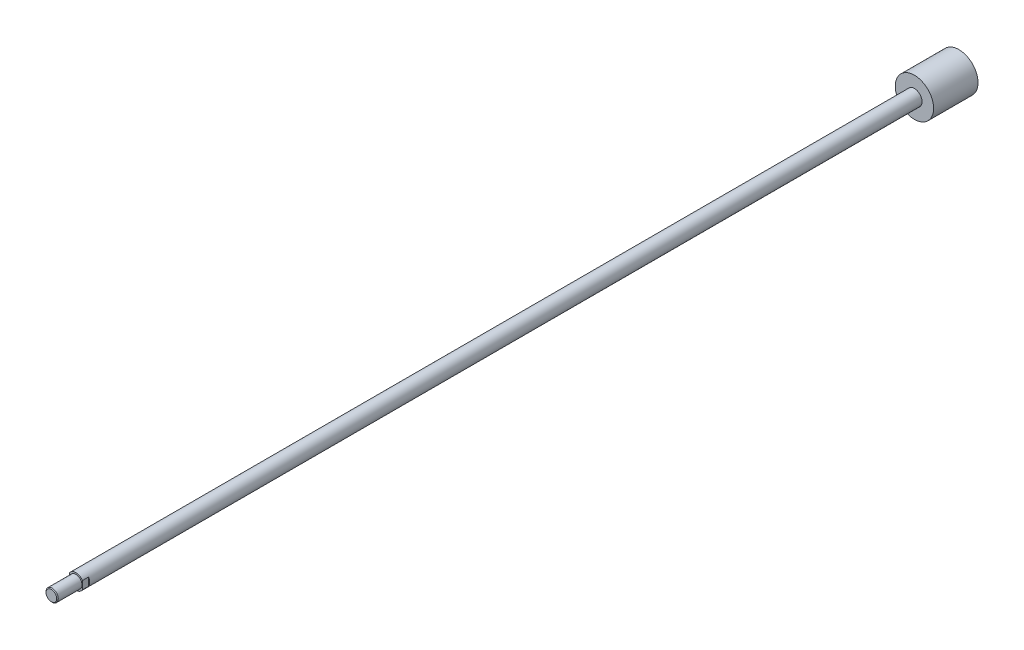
ISO-10303-21;
HEADER;
FILE_DESCRIPTION(('STEP AP214'),'2;1');
FILE_NAME('part.step','',(''),(''),'','','');
FILE_SCHEMA(('AUTOMOTIVE_DESIGN { 1 0 10303 214 1 1 1 1 }'));
ENDSEC;
DATA;
#1=APPLICATION_CONTEXT('core data for automotive mechanical design processes');
#2=APPLICATION_PROTOCOL_DEFINITION('international standard','automotive_design',2000,#1);
#3=PRODUCT_CONTEXT('',#1,'mechanical');
#4=PRODUCT('Part','Part','',(#3));
#5=PRODUCT_RELATED_PRODUCT_CATEGORY('part','',(#4));
#6=PRODUCT_DEFINITION_FORMATION('','',#4);
#7=PRODUCT_DEFINITION_CONTEXT('part definition',#1,'design');
#8=PRODUCT_DEFINITION('design','',#6,#7);
#9=PRODUCT_DEFINITION_SHAPE('','',#8);
#10=(LENGTH_UNIT() NAMED_UNIT(*) SI_UNIT(.MILLI.,.METRE.));
#11=(NAMED_UNIT(*) PLANE_ANGLE_UNIT() SI_UNIT($,.RADIAN.));
#12=(NAMED_UNIT(*) SI_UNIT($,.STERADIAN.) SOLID_ANGLE_UNIT());
#13=UNCERTAINTY_MEASURE_WITH_UNIT(LENGTH_MEASURE(1.E-05),#10,'distance_accuracy_value','');
#14=(GEOMETRIC_REPRESENTATION_CONTEXT(3) GLOBAL_UNCERTAINTY_ASSIGNED_CONTEXT((#13)) GLOBAL_UNIT_ASSIGNED_CONTEXT((#10,
#11,#12)) REPRESENTATION_CONTEXT('',''));
#15=CARTESIAN_POINT('',(0.,0.,0.));
#16=DIRECTION('',(0.,0.,1.));
#17=DIRECTION('',(1.,0.,0.));
#18=AXIS2_PLACEMENT_3D('',#15,#16,#17);
#19=CARTESIAN_POINT('',(0.,0.,1152.));
#20=DIRECTION('',(0.,0.,1.));
#21=DIRECTION('',(1.,0.,0.));
#22=AXIS2_PLACEMENT_3D('',#19,#20,#21);
#23=PLANE('',#22);
#24=DIRECTION('',(0.,-1.,0.));
#25=VECTOR('',#24,1.);
#26=CARTESIAN_POINT('',(8.5,5.26782687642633,1152.));
#27=LINE('',#26,#25);
#28=CARTESIAN_POINT('',(8.5,5.26782687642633,1152.));
#29=VERTEX_POINT('',#28);
#30=CARTESIAN_POINT('',(8.5,-5.26782687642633,1152.));
#31=VERTEX_POINT('',#30);
#32=EDGE_CURVE('E66',#29,#31,#27,.T.);
#33=ORIENTED_EDGE('',*,*,#32,.F.);
#34=CARTESIAN_POINT('',(0.,0.,1152.));
#35=DIRECTION('',(0.,0.,1.));
#36=DIRECTION('',(1.,0.,0.));
#37=AXIS2_PLACEMENT_3D('',#34,#35,#36);
#38=CIRCLE('',#37,9.99999999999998);
#39=CARTESIAN_POINT('',(-8.5,5.26782687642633,1152.));
#40=VERTEX_POINT('',#39);
#41=EDGE_CURVE('E75',#29,#40,#38,.T.);
#42=ORIENTED_EDGE('',*,*,#41,.T.);
#43=DIRECTION('',(0.,1.,0.));
#44=VECTOR('',#43,1.);
#45=CARTESIAN_POINT('',(-8.5,5.26782687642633,1152.));
#46=LINE('',#45,#44);
#47=CARTESIAN_POINT('',(-8.5,-5.26782687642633,1152.));
#48=VERTEX_POINT('',#47);
#49=EDGE_CURVE('E77',#48,#40,#46,.T.);
#50=ORIENTED_EDGE('',*,*,#49,.F.);
#51=EDGE_CURVE('E90',#48,#31,#38,.T.);
#52=ORIENTED_EDGE('',*,*,#51,.T.);
#53=EDGE_LOOP('',(#33,#42,#50,#52));
#54=FACE_BOUND('',#53,.T.);
#55=CARTESIAN_POINT('',(0.,0.,1152.));
#56=DIRECTION('',(0.,0.,1.));
#57=DIRECTION('',(1.,0.,0.));
#58=AXIS2_PLACEMENT_3D('',#55,#56,#57);
#59=CIRCLE('',#58,8.);
#60=CARTESIAN_POINT('',(8.,0.,1152.));
#61=VERTEX_POINT('',#60);
#62=EDGE_CURVE('E230',#61,#61,#59,.T.);
#63=ORIENTED_EDGE('',*,*,#62,.F.);
#64=EDGE_LOOP('',(#63));
#65=FACE_BOUND('',#64,.T.);
#66=ADVANCED_FACE('F17',(#54,#65),#23,.T.);
#67=CARTESIAN_POINT('',(0.,0.,0.));
#68=DIRECTION('',(0.,0.,-1.));
#69=DIRECTION('',(-1.,0.,0.));
#70=AXIS2_PLACEMENT_3D('',#67,#68,#69);
#71=PLANE('',#70);
#72=CARTESIAN_POINT('',(0.,0.,0.));
#73=DIRECTION('',(0.,0.,-1.));
#74=DIRECTION('',(-1.,0.,0.));
#75=AXIS2_PLACEMENT_3D('',#72,#73,#74);
#76=CIRCLE('',#75,25.);
#77=CARTESIAN_POINT('',(-25.,0.,0.));
#78=VERTEX_POINT('',#77);
#79=EDGE_CURVE('E99',#78,#78,#76,.T.);
#80=ORIENTED_EDGE('',*,*,#79,.T.);
#81=EDGE_LOOP('',(#80));
#82=FACE_BOUND('',#81,.T.);
#83=ADVANCED_FACE('F117',(#82),#71,.T.);
#84=CARTESIAN_POINT('',(0.,0.,-31.0732569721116));
#85=DIRECTION('',(0.,0.,-1.));
#86=DIRECTION('',(-1.,0.,0.));
#87=AXIS2_PLACEMENT_3D('',#84,#85,#86);
#88=CYLINDRICAL_SURFACE('',#87,25.);
#89=CARTESIAN_POINT('',(0.,0.,58.));
#90=DIRECTION('',(0.,0.,-1.));
#91=DIRECTION('',(-1.,0.,0.));
#92=AXIS2_PLACEMENT_3D('',#89,#90,#91);
#93=CIRCLE('',#92,25.);
#94=CARTESIAN_POINT('',(-25.,0.,58.));
#95=VERTEX_POINT('',#94);
#96=EDGE_CURVE('E96',#95,#95,#93,.T.);
#97=ORIENTED_EDGE('',*,*,#96,.T.);
#98=EDGE_LOOP('',(#97));
#99=FACE_BOUND('',#98,.T.);
#100=ORIENTED_EDGE('',*,*,#79,.F.);
#101=EDGE_LOOP('',(#100));
#102=FACE_BOUND('',#101,.T.);
#103=ADVANCED_FACE('F124',(#99,#102),#88,.T.);
#104=CARTESIAN_POINT('',(0.,25.,58.));
#105=DIRECTION('',(0.,0.,1.));
#106=DIRECTION('',(1.,0.,0.));
#107=AXIS2_PLACEMENT_3D('',#104,#105,#106);
#108=PLANE('',#107);
#109=CARTESIAN_POINT('',(0.,0.,58.));
#110=DIRECTION('',(0.,0.,-1.));
#111=DIRECTION('',(-1.,0.,0.));
#112=AXIS2_PLACEMENT_3D('',#109,#110,#111);
#113=CIRCLE('',#112,9.99999999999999);
#114=CARTESIAN_POINT('',(-9.99999999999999,0.,58.));
#115=VERTEX_POINT('',#114);
#116=EDGE_CURVE('E93',#115,#115,#113,.T.);
#117=ORIENTED_EDGE('',*,*,#116,.T.);
#118=EDGE_LOOP('',(#117));
#119=FACE_BOUND('',#118,.T.);
#120=ORIENTED_EDGE('',*,*,#96,.F.);
#121=EDGE_LOOP('',(#120));
#122=FACE_BOUND('',#121,.T.);
#123=ADVANCED_FACE('F133',(#119,#122),#108,.T.);
#124=CARTESIAN_POINT('',(0.,0.,-31.0732569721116));
#125=DIRECTION('',(0.,0.,-1.));
#126=DIRECTION('',(-1.,0.,0.));
#127=AXIS2_PLACEMENT_3D('',#124,#125,#126);
#128=CYLINDRICAL_SURFACE('',#127,9.99999999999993);
#129=DIRECTION('',(0.,0.,1.));
#130=VECTOR('',#129,1.);
#131=CARTESIAN_POINT('',(8.5,5.26782687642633,1144.));
#132=LINE('',#131,#130);
#133=CARTESIAN_POINT('',(8.5,5.26782687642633,1144.));
#134=VERTEX_POINT('',#133);
#135=EDGE_CURVE('E32',#134,#29,#132,.T.);
#136=ORIENTED_EDGE('',*,*,#135,.F.);
#137=CARTESIAN_POINT('',(0.,0.,1144.));
#138=DIRECTION('',(0.,0.,1.));
#139=DIRECTION('',(1.,0.,0.));
#140=AXIS2_PLACEMENT_3D('',#137,#138,#139);
#141=CIRCLE('',#140,9.99999999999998);
#142=CARTESIAN_POINT('',(8.5,-5.26782687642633,1144.));
#143=VERTEX_POINT('',#142);
#144=EDGE_CURVE('E61',#143,#134,#141,.T.);
#145=ORIENTED_EDGE('',*,*,#144,.F.);
#146=DIRECTION('',(0.,0.,1.));
#147=VECTOR('',#146,1.);
#148=CARTESIAN_POINT('',(8.5,-5.26782687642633,1144.));
#149=LINE('',#148,#147);
#150=EDGE_CURVE('E69',#143,#31,#149,.T.);
#151=ORIENTED_EDGE('',*,*,#150,.T.);
#152=ORIENTED_EDGE('',*,*,#51,.F.);
#153=DIRECTION('',(0.,0.,1.));
#154=VECTOR('',#153,1.);
#155=CARTESIAN_POINT('',(-8.5,-5.26782687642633,1144.));
#156=LINE('',#155,#154);
#157=CARTESIAN_POINT('',(-8.5,-5.26782687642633,1144.));
#158=VERTEX_POINT('',#157);
#159=EDGE_CURVE('E40',#158,#48,#156,.T.);
#160=ORIENTED_EDGE('',*,*,#159,.F.);
#161=CARTESIAN_POINT('',(0.,0.,1144.));
#162=DIRECTION('',(0.,0.,1.));
#163=DIRECTION('',(1.,0.,0.));
#164=AXIS2_PLACEMENT_3D('',#161,#162,#163);
#165=CIRCLE('',#164,9.99999999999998);
#166=CARTESIAN_POINT('',(-8.5,5.26782687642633,1144.));
#167=VERTEX_POINT('',#166);
#168=EDGE_CURVE('E81',#167,#158,#165,.T.);
#169=ORIENTED_EDGE('',*,*,#168,.F.);
#170=DIRECTION('',(0.,0.,1.));
#171=VECTOR('',#170,1.);
#172=CARTESIAN_POINT('',(-8.5,5.26782687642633,1144.));
#173=LINE('',#172,#171);
#174=EDGE_CURVE('E87',#167,#40,#173,.T.);
#175=ORIENTED_EDGE('',*,*,#174,.T.);
#176=ORIENTED_EDGE('',*,*,#41,.F.);
#177=EDGE_LOOP('',(#136,#145,#151,#152,#160,#169,#175,#176));
#178=FACE_BOUND('',#177,.T.);
#179=ORIENTED_EDGE('',*,*,#116,.F.);
#180=EDGE_LOOP('',(#179));
#181=FACE_BOUND('',#180,.T.);
#182=ADVANCED_FACE('F72',(#178,#181),#128,.T.);
#183=CARTESIAN_POINT('',(-8.5,5.26782687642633,1144.));
#184=DIRECTION('',(1.,0.,0.));
#185=DIRECTION('',(0.,0.,-1.));
#186=AXIS2_PLACEMENT_3D('',#183,#184,#185);
#187=PLANE('',#186);
#188=ORIENTED_EDGE('',*,*,#49,.T.);
#189=ORIENTED_EDGE('',*,*,#174,.F.);
#190=DIRECTION('',(0.,1.,0.));
#191=VECTOR('',#190,1.);
#192=CARTESIAN_POINT('',(-8.5,5.26782687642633,1144.));
#193=LINE('',#192,#191);
#194=EDGE_CURVE('E83',#158,#167,#193,.T.);
#195=ORIENTED_EDGE('',*,*,#194,.F.);
#196=ORIENTED_EDGE('',*,*,#159,.T.);
#197=EDGE_LOOP('',(#188,#189,#195,#196));
#198=FACE_BOUND('',#197,.T.);
#199=ADVANCED_FACE('F129',(#198),#187,.F.);
#200=CARTESIAN_POINT('',(0.,0.,1144.));
#201=DIRECTION('',(0.,0.,1.));
#202=DIRECTION('',(1.,0.,0.));
#203=AXIS2_PLACEMENT_3D('',#200,#201,#202);
#204=PLANE('',#203);
#205=ORIENTED_EDGE('',*,*,#168,.T.);
#206=ORIENTED_EDGE('',*,*,#194,.T.);
#207=EDGE_LOOP('',(#205,#206));
#208=FACE_BOUND('',#207,.T.);
#209=ADVANCED_FACE('F169',(#208),#204,.T.);
#210=CARTESIAN_POINT('',(8.5,5.26782687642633,1144.));
#211=DIRECTION('',(-1.,0.,0.));
#212=DIRECTION('',(0.,0.,1.));
#213=AXIS2_PLACEMENT_3D('',#210,#211,#212);
#214=PLANE('',#213);
#215=ORIENTED_EDGE('',*,*,#32,.T.);
#216=ORIENTED_EDGE('',*,*,#150,.F.);
#217=DIRECTION('',(0.,-1.,0.));
#218=VECTOR('',#217,1.);
#219=CARTESIAN_POINT('',(8.5,5.26782687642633,1144.));
#220=LINE('',#219,#218);
#221=EDGE_CURVE('E63',#134,#143,#220,.T.);
#222=ORIENTED_EDGE('',*,*,#221,.F.);
#223=ORIENTED_EDGE('',*,*,#135,.T.);
#224=EDGE_LOOP('',(#215,#216,#222,#223));
#225=FACE_BOUND('',#224,.T.);
#226=ADVANCED_FACE('F68',(#225),#214,.F.);
#227=CARTESIAN_POINT('',(0.,0.,1144.));
#228=DIRECTION('',(0.,0.,1.));
#229=DIRECTION('',(1.,0.,0.));
#230=AXIS2_PLACEMENT_3D('',#227,#228,#229);
#231=PLANE('',#230);
#232=ORIENTED_EDGE('',*,*,#144,.T.);
#233=ORIENTED_EDGE('',*,*,#221,.T.);
#234=EDGE_LOOP('',(#232,#233));
#235=FACE_BOUND('',#234,.T.);
#236=ADVANCED_FACE('F62',(#235),#231,.T.);
#237=CARTESIAN_POINT('',(0.,0.,1184.));
#238=DIRECTION('',(0.,0.,-1.));
#239=DIRECTION('',(-1.,0.,0.));
#240=AXIS2_PLACEMENT_3D('',#237,#238,#239);
#241=CYLINDRICAL_SURFACE('',#240,8.);
#242=CARTESIAN_POINT('',(0.,0.,1183.));
#243=DIRECTION('',(0.,0.,1.));
#244=DIRECTION('',(1.,0.,0.));
#245=AXIS2_PLACEMENT_3D('',#242,#243,#244);
#246=CIRCLE('',#245,8.);
#247=CARTESIAN_POINT('',(8.,0.,1183.));
#248=VERTEX_POINT('',#247);
#249=EDGE_CURVE('E11',#248,#248,#246,.F.);
#250=ORIENTED_EDGE('',*,*,#249,.T.);
#251=EDGE_LOOP('',(#250));
#252=FACE_BOUND('',#251,.T.);
#253=ORIENTED_EDGE('',*,*,#62,.T.);
#254=EDGE_LOOP('',(#253));
#255=FACE_BOUND('',#254,.T.);
#256=ADVANCED_FACE('F113',(#252,#255),#241,.T.);
#257=CARTESIAN_POINT('',(0.,0.,1184.));
#258=DIRECTION('',(0.,0.,1.));
#259=DIRECTION('',(1.,0.,0.));
#260=AXIS2_PLACEMENT_3D('',#257,#258,#259);
#261=PLANE('',#260);
#262=CARTESIAN_POINT('',(0.,0.,1184.));
#263=DIRECTION('',(0.,0.,1.));
#264=DIRECTION('',(1.,0.,0.));
#265=AXIS2_PLACEMENT_3D('',#262,#263,#264);
#266=CIRCLE('',#265,7.00000000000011);
#267=CARTESIAN_POINT('',(7.00000000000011,0.,1184.));
#268=VERTEX_POINT('',#267);
#269=EDGE_CURVE('E25',#268,#268,#266,.T.);
#270=ORIENTED_EDGE('',*,*,#269,.T.);
#271=EDGE_LOOP('',(#270));
#272=FACE_BOUND('',#271,.T.);
#273=ADVANCED_FACE('F104',(#272),#261,.T.);
#274=CARTESIAN_POINT('',(0.,0.,1184.));
#275=DIRECTION('',(0.,0.,-1.));
#276=DIRECTION('',(-1.,0.,0.));
#277=AXIS2_PLACEMENT_3D('',#274,#275,#276);
#278=CONICAL_SURFACE('',#277,7.00000000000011,0.785398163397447);
#279=ORIENTED_EDGE('',*,*,#249,.F.);
#280=EDGE_LOOP('',(#279));
#281=FACE_BOUND('',#280,.T.);
#282=ORIENTED_EDGE('',*,*,#269,.F.);
#283=EDGE_LOOP('',(#282));
#284=FACE_BOUND('',#283,.T.);
#285=ADVANCED_FACE('F19',(#281,#284),#278,.T.);
#286=CLOSED_SHELL('',(#66,#83,#103,#123,#182,#199,#209,#226,#236,#256,#273,#285));
#287=MANIFOLD_SOLID_BREP('B1',#286);
#288=ADVANCED_BREP_SHAPE_REPRESENTATION('',(#18,#287),#14);
#289=SHAPE_DEFINITION_REPRESENTATION(#9,#288);
ENDSEC;
END-ISO-10303-21;
